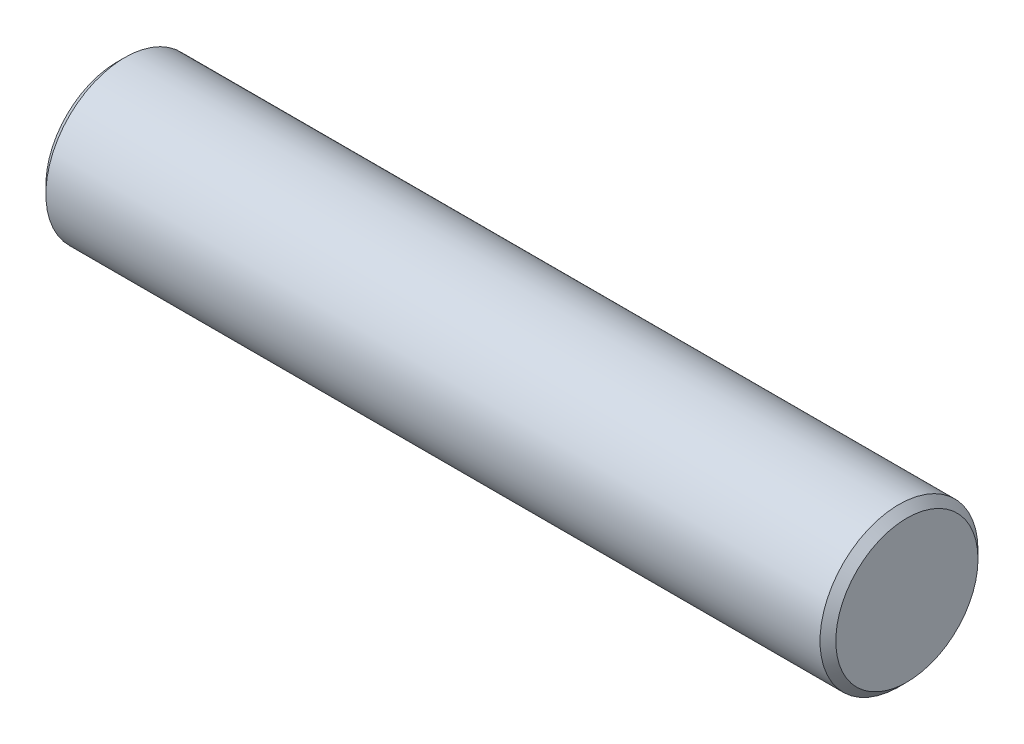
ISO-10303-21;
HEADER;
FILE_DESCRIPTION(('STEP AP214'),'2;1');
FILE_NAME('part.step','',(''),(''),'','','');
FILE_SCHEMA(('AUTOMOTIVE_DESIGN { 1 0 10303 214 1 1 1 1 }'));
ENDSEC;
DATA;
#1=APPLICATION_CONTEXT('core data for automotive mechanical design processes');
#2=APPLICATION_PROTOCOL_DEFINITION('international standard','automotive_design',2000,#1);
#3=PRODUCT_CONTEXT('',#1,'mechanical');
#4=PRODUCT('Part','Part','',(#3));
#5=PRODUCT_RELATED_PRODUCT_CATEGORY('part','',(#4));
#6=PRODUCT_DEFINITION_FORMATION('','',#4);
#7=PRODUCT_DEFINITION_CONTEXT('part definition',#1,'design');
#8=PRODUCT_DEFINITION('design','',#6,#7);
#9=PRODUCT_DEFINITION_SHAPE('','',#8);
#10=(LENGTH_UNIT() NAMED_UNIT(*) SI_UNIT(.MILLI.,.METRE.));
#11=(NAMED_UNIT(*) PLANE_ANGLE_UNIT() SI_UNIT($,.RADIAN.));
#12=(NAMED_UNIT(*) SI_UNIT($,.STERADIAN.) SOLID_ANGLE_UNIT());
#13=UNCERTAINTY_MEASURE_WITH_UNIT(LENGTH_MEASURE(1.E-05),#10,'distance_accuracy_value','');
#14=(GEOMETRIC_REPRESENTATION_CONTEXT(3) GLOBAL_UNCERTAINTY_ASSIGNED_CONTEXT((#13)) GLOBAL_UNIT_ASSIGNED_CONTEXT((#10,
#11,#12)) REPRESENTATION_CONTEXT('',''));
#15=CARTESIAN_POINT('',(0.,0.,0.));
#16=DIRECTION('',(0.,0.,1.));
#17=DIRECTION('',(1.,0.,0.));
#18=AXIS2_PLACEMENT_3D('',#15,#16,#17);
#19=CARTESIAN_POINT('',(25.,0.,0.));
#20=DIRECTION('',(-1.,0.,0.));
#21=DIRECTION('',(0.,0.,1.));
#22=AXIS2_PLACEMENT_3D('',#19,#20,#21);
#23=CYLINDRICAL_SURFACE('',#22,5.);
#24=CARTESIAN_POINT('',(-24.5,0.,0.));
#25=DIRECTION('',(1.,0.,0.));
#26=DIRECTION('',(0.,0.,-1.));
#27=AXIS2_PLACEMENT_3D('',#24,#25,#26);
#28=CIRCLE('',#27,5.);
#29=CARTESIAN_POINT('',(-24.5,0.,-5.));
#30=VERTEX_POINT('',#29);
#31=EDGE_CURVE('E40',#30,#30,#28,.T.);
#32=ORIENTED_EDGE('',*,*,#31,.T.);
#33=EDGE_LOOP('',(#32));
#34=FACE_BOUND('',#33,.T.);
#35=CARTESIAN_POINT('',(24.5,0.,0.));
#36=DIRECTION('',(1.,0.,0.));
#37=DIRECTION('',(0.,0.,-1.));
#38=AXIS2_PLACEMENT_3D('',#35,#36,#37);
#39=CIRCLE('',#38,5.);
#40=CARTESIAN_POINT('',(24.5,0.,-5.));
#41=VERTEX_POINT('',#40);
#42=EDGE_CURVE('E44',#41,#41,#39,.F.);
#43=ORIENTED_EDGE('',*,*,#42,.T.);
#44=EDGE_LOOP('',(#43));
#45=FACE_BOUND('',#44,.T.);
#46=ADVANCED_FACE('F29',(#34,#45),#23,.T.);
#47=CARTESIAN_POINT('',(25.,0.,0.));
#48=DIRECTION('',(1.,0.,0.));
#49=DIRECTION('',(0.,0.,-1.));
#50=AXIS2_PLACEMENT_3D('',#47,#48,#49);
#51=PLANE('',#50);
#52=CARTESIAN_POINT('',(25.,0.,0.));
#53=DIRECTION('',(1.,0.,0.));
#54=DIRECTION('',(0.,0.,-1.));
#55=AXIS2_PLACEMENT_3D('',#52,#53,#54);
#56=CIRCLE('',#55,4.49999999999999);
#57=CARTESIAN_POINT('',(25.,0.,-4.49999999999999));
#58=VERTEX_POINT('',#57);
#59=EDGE_CURVE('E10',#58,#58,#56,.T.);
#60=ORIENTED_EDGE('',*,*,#59,.T.);
#61=EDGE_LOOP('',(#60));
#62=FACE_BOUND('',#61,.T.);
#63=ADVANCED_FACE('F60',(#62),#51,.T.);
#64=CARTESIAN_POINT('',(-25.,0.,0.));
#65=DIRECTION('',(1.,0.,0.));
#66=DIRECTION('',(0.,0.,-1.));
#67=AXIS2_PLACEMENT_3D('',#64,#65,#66);
#68=PLANE('',#67);
#69=CARTESIAN_POINT('',(-25.,0.,0.));
#70=DIRECTION('',(1.,0.,0.));
#71=DIRECTION('',(0.,0.,-1.));
#72=AXIS2_PLACEMENT_3D('',#69,#70,#71);
#73=CIRCLE('',#72,4.5);
#74=CARTESIAN_POINT('',(-25.,0.,-4.5));
#75=VERTEX_POINT('',#74);
#76=EDGE_CURVE('E36',#75,#75,#73,.F.);
#77=ORIENTED_EDGE('',*,*,#76,.T.);
#78=EDGE_LOOP('',(#77));
#79=FACE_BOUND('',#78,.T.);
#80=ADVANCED_FACE('F57',(#79),#68,.F.);
#81=CARTESIAN_POINT('',(-24.5,0.,0.));
#82=DIRECTION('',(1.,0.,0.));
#83=DIRECTION('',(0.,0.,-1.));
#84=AXIS2_PLACEMENT_3D('',#81,#82,#83);
#85=CONICAL_SURFACE('',#84,5.,0.785398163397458);
#86=ORIENTED_EDGE('',*,*,#76,.F.);
#87=EDGE_LOOP('',(#86));
#88=FACE_BOUND('',#87,.T.);
#89=ORIENTED_EDGE('',*,*,#31,.F.);
#90=EDGE_LOOP('',(#89));
#91=FACE_BOUND('',#90,.T.);
#92=ADVANCED_FACE('F53',(#88,#91),#85,.T.);
#93=CARTESIAN_POINT('',(25.,0.,0.));
#94=DIRECTION('',(-1.,0.,0.));
#95=DIRECTION('',(0.,0.,1.));
#96=AXIS2_PLACEMENT_3D('',#93,#94,#95);
#97=CONICAL_SURFACE('',#96,4.49999999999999,0.785398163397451);
#98=ORIENTED_EDGE('',*,*,#42,.F.);
#99=EDGE_LOOP('',(#98));
#100=FACE_BOUND('',#99,.T.);
#101=ORIENTED_EDGE('',*,*,#59,.F.);
#102=EDGE_LOOP('',(#101));
#103=FACE_BOUND('',#102,.T.);
#104=ADVANCED_FACE('F31',(#100,#103),#97,.T.);
#105=CLOSED_SHELL('',(#46,#63,#80,#92,#104));
#106=MANIFOLD_SOLID_BREP('B2',#105);
#107=ADVANCED_BREP_SHAPE_REPRESENTATION('',(#18,#106),#14);
#108=SHAPE_DEFINITION_REPRESENTATION(#9,#107);
ENDSEC;
END-ISO-10303-21;
